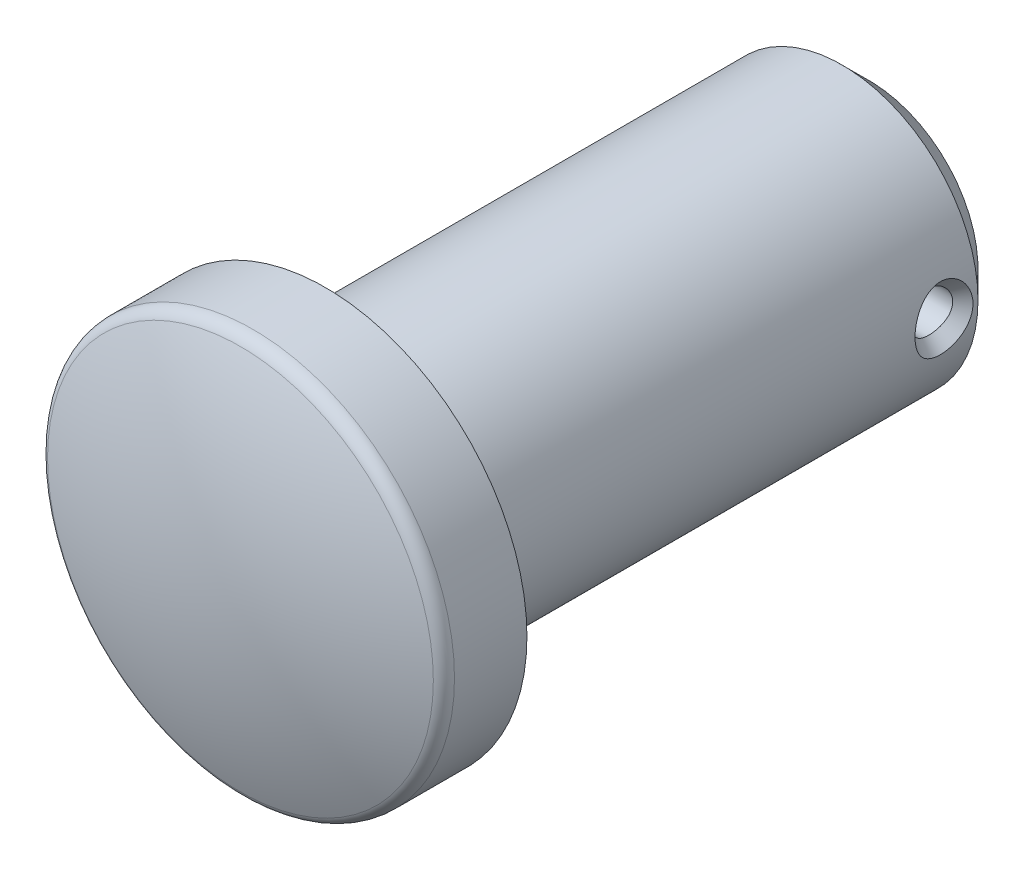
ISO-10303-21;
HEADER;
FILE_DESCRIPTION(('STEP AP214'),'2;1');
FILE_NAME('part.step','',(''),(''),'','','');
FILE_SCHEMA(('AUTOMOTIVE_DESIGN { 1 0 10303 214 1 1 1 1 }'));
ENDSEC;
DATA;
#1=APPLICATION_CONTEXT('core data for automotive mechanical design processes');
#2=APPLICATION_PROTOCOL_DEFINITION('international standard','automotive_design',2000,#1);
#3=PRODUCT_CONTEXT('',#1,'mechanical');
#4=PRODUCT('Part','Part','',(#3));
#5=PRODUCT_RELATED_PRODUCT_CATEGORY('part','',(#4));
#6=PRODUCT_DEFINITION_FORMATION('','',#4);
#7=PRODUCT_DEFINITION_CONTEXT('part definition',#1,'design');
#8=PRODUCT_DEFINITION('design','',#6,#7);
#9=PRODUCT_DEFINITION_SHAPE('','',#8);
#10=(LENGTH_UNIT() NAMED_UNIT(*) SI_UNIT(.MILLI.,.METRE.));
#11=(NAMED_UNIT(*) PLANE_ANGLE_UNIT() SI_UNIT($,.RADIAN.));
#12=(NAMED_UNIT(*) SI_UNIT($,.STERADIAN.) SOLID_ANGLE_UNIT());
#13=UNCERTAINTY_MEASURE_WITH_UNIT(LENGTH_MEASURE(1.E-05),#10,'distance_accuracy_value','');
#14=(GEOMETRIC_REPRESENTATION_CONTEXT(3) GLOBAL_UNCERTAINTY_ASSIGNED_CONTEXT((#13)) GLOBAL_UNIT_ASSIGNED_CONTEXT((#10,
#11,#12)) REPRESENTATION_CONTEXT('',''));
#15=CARTESIAN_POINT('',(0.,0.,0.));
#16=DIRECTION('',(0.,0.,1.));
#17=DIRECTION('',(1.,0.,0.));
#18=AXIS2_PLACEMENT_3D('',#15,#16,#17);
#19=CARTESIAN_POINT('',(5.852080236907,294.719989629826,0.));
#20=DIRECTION('',(0.,0.,1.));
#21=DIRECTION('',(1.,0.,0.));
#22=AXIS2_PLACEMENT_3D('',#19,#20,#21);
#23=PLANE('',#22);
#24=CARTESIAN_POINT('',(5.852080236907,294.719989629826,0.));
#25=DIRECTION('',(0.,0.,1.));
#26=DIRECTION('',(1.,0.,0.));
#27=AXIS2_PLACEMENT_3D('',#24,#25,#26);
#28=CIRCLE('',#27,14.8184804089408);
#29=CARTESIAN_POINT('',(20.6705606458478,294.719989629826,0.));
#30=VERTEX_POINT('',#29);
#31=EDGE_CURVE('E177',#30,#30,#28,.T.);
#32=ORIENTED_EDGE('',*,*,#31,.F.);
#33=EDGE_LOOP('',(#32));
#34=FACE_BOUND('',#33,.T.);
#35=CARTESIAN_POINT('',(5.852080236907,294.719989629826,0.));
#36=DIRECTION('',(0.,0.,1.));
#37=DIRECTION('',(1.,0.,0.));
#38=AXIS2_PLACEMENT_3D('',#35,#36,#37);
#39=CIRCLE('',#38,10.);
#40=CARTESIAN_POINT('',(15.852080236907,294.719989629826,0.));
#41=VERTEX_POINT('',#40);
#42=EDGE_CURVE('E180',#41,#41,#39,.F.);
#43=ORIENTED_EDGE('',*,*,#42,.F.);
#44=EDGE_LOOP('',(#43));
#45=FACE_BOUND('',#44,.T.);
#46=ADVANCED_FACE('F33',(#34,#45),#23,.F.);
#47=CARTESIAN_POINT('',(5.852080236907,294.719989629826,6.));
#48=DIRECTION('',(0.,0.,-1.));
#49=DIRECTION('',(-1.,0.,0.));
#50=AXIS2_PLACEMENT_3D('',#47,#48,#49);
#51=CYLINDRICAL_SURFACE('',#50,14.8184804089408);
#52=CARTESIAN_POINT('',(5.852080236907,294.719989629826,5.33034058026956));
#53=DIRECTION('',(0.,0.,-1.));
#54=DIRECTION('',(-1.,0.,0.));
#55=AXIS2_PLACEMENT_3D('',#52,#53,#54);
#56=CIRCLE('',#55,14.8184804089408);
#57=CARTESIAN_POINT('',(-8.9664001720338,294.719989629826,5.33034058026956));
#58=VERTEX_POINT('',#57);
#59=EDGE_CURVE('E60',#58,#58,#56,.T.);
#60=ORIENTED_EDGE('',*,*,#59,.T.);
#61=EDGE_LOOP('',(#60));
#62=FACE_BOUND('',#61,.T.);
#63=ORIENTED_EDGE('',*,*,#31,.T.);
#64=EDGE_LOOP('',(#63));
#65=FACE_BOUND('',#64,.T.);
#66=ADVANCED_FACE('F169',(#62,#65),#51,.T.);
#67=CARTESIAN_POINT('',(5.852080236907,294.719989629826,-29.0978936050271));
#68=DIRECTION('',(0.,0.,1.));
#69=DIRECTION('',(1.,0.,0.));
#70=AXIS2_PLACEMENT_3D('',#67,#68,#69);
#71=SPHERICAL_SURFACE('',#70,38.0978936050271);
#72=CARTESIAN_POINT('',(5.852080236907,294.719989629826,6.25837801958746));
#73=DIRECTION('',(0.,0.,-1.));
#74=DIRECTION('',(-1.,0.,0.));
#75=AXIS2_PLACEMENT_3D('',#72,#73,#74);
#76=CIRCLE('',#75,14.1909673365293);
#77=CARTESIAN_POINT('',(-8.33888709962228,294.719989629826,6.25837801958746));
#78=VERTEX_POINT('',#77);
#79=EDGE_CURVE('E65',#78,#78,#76,.F.);
#80=ORIENTED_EDGE('',*,*,#79,.T.);
#81=EDGE_LOOP('',(#80));
#82=FACE_BOUND('',#81,.T.);
#83=ADVANCED_FACE('F89',(#82),#71,.T.);
#84=CARTESIAN_POINT('',(5.852080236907,294.719989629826,-40.));
#85=DIRECTION('',(0.,0.,1.));
#86=DIRECTION('',(1.,0.,0.));
#87=AXIS2_PLACEMENT_3D('',#84,#85,#86);
#88=CYLINDRICAL_SURFACE('',#87,10.);
#89=CARTESIAN_POINT('',(15.852073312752,294.731757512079,-37.6315583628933));
#90=CARTESIAN_POINT('',(15.8520311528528,294.770087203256,-37.6309884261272));
#91=CARTESIAN_POINT('',(15.8517420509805,294.808401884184,-37.6295174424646));
#92=CARTESIAN_POINT('',(15.850695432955,294.88483731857,-37.6248028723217));
#93=CARTESIAN_POINT('',(15.8499388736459,294.922958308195,-37.6215629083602));
#94=CARTESIAN_POINT('',(15.8479843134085,294.998926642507,-37.6133452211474));
#95=CARTESIAN_POINT('',(15.8467871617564,295.036774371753,-37.6083708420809));
#96=CARTESIAN_POINT('',(15.8439784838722,295.11211744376,-37.5967193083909));
#97=CARTESIAN_POINT('',(15.8423677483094,295.149613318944,-37.5900454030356));
#98=CARTESIAN_POINT('',(15.8387588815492,295.224173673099,-37.5750295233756));
#99=CARTESIAN_POINT('',(15.8367615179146,295.261238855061,-37.5666908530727));
#100=CARTESIAN_POINT('',(15.8324063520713,295.334858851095,-37.5483800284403));
#101=CARTESIAN_POINT('',(15.8300493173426,295.371414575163,-37.5384113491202));
#102=CARTESIAN_POINT('',(15.8250017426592,295.443936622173,-37.5168749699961));
#103=CARTESIAN_POINT('',(15.8223119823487,295.479904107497,-37.5053110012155));
#104=CARTESIAN_POINT('',(15.816625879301,295.551170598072,-37.4806184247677));
#105=CARTESIAN_POINT('',(15.813630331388,295.58647106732,-37.4674938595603));
#106=CARTESIAN_POINT('',(15.8073595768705,295.656324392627,-37.4397144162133));
#107=CARTESIAN_POINT('',(15.8040851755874,295.690879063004,-37.4250639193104));
#108=CARTESIAN_POINT('',(15.7972836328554,295.759161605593,-37.3942669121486));
#109=CARTESIAN_POINT('',(15.7937572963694,295.792891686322,-37.3781251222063));
#110=CARTESIAN_POINT('',(15.7864788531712,295.859445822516,-37.3443798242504));
#111=CARTESIAN_POINT('',(15.7827275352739,295.892272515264,-37.3267813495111));
#112=CARTESIAN_POINT('',(15.7750259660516,295.95694060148,-37.2901570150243));
#113=CARTESIAN_POINT('',(15.771076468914,295.988785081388,-37.27113644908));
#114=CARTESIAN_POINT('',(15.7630059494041,296.051409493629,-37.2317022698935));
#115=CARTESIAN_POINT('',(15.7588856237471,296.082192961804,-37.2112941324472));
#116=CARTESIAN_POINT('',(15.7504988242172,296.142615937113,-37.1691193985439));
#117=CARTESIAN_POINT('',(15.7462329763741,296.172259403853,-37.147358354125));
#118=CARTESIAN_POINT('',(15.7375881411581,296.230323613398,-37.1025118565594));
#119=CARTESIAN_POINT('',(15.7332096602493,296.258748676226,-37.0794319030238));
#120=CARTESIAN_POINT('',(15.7243443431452,296.314295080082,-37.0319841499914));
#121=CARTESIAN_POINT('',(15.7198579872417,296.341421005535,-37.0076216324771));
#122=CARTESIAN_POINT('',(15.7108895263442,296.394279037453,-36.9576534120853));
#123=CARTESIAN_POINT('',(15.7064074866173,296.420016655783,-36.9320535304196));
#124=CARTESIAN_POINT('',(15.6975612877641,296.470048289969,-36.8796943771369));
#125=CARTESIAN_POINT('',(15.6931966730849,296.494348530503,-36.8529411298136));
#126=CARTESIAN_POINT('',(15.6845906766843,296.541467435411,-36.7983521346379));
#127=CARTESIAN_POINT('',(15.6803488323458,296.564292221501,-36.7705217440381));
#128=CARTESIAN_POINT('',(15.672021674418,296.608424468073,-36.7138528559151));
#129=CARTESIAN_POINT('',(15.6679357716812,296.629737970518,-36.6850191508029));
#130=CARTESIAN_POINT('',(15.6599463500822,296.670811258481,-36.6264185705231));
#131=CARTESIAN_POINT('',(15.6560421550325,296.690577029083,-36.5966559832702));
#132=CARTESIAN_POINT('',(15.6484439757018,296.72851859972,-36.5362723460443));
#133=CARTESIAN_POINT('',(15.6447492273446,296.746700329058,-36.5056551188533));
#134=CARTESIAN_POINT('',(15.6375972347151,296.781437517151,-36.4436369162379));
#135=CARTESIAN_POINT('',(15.6341391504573,296.79799882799,-36.412239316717));
#136=CARTESIAN_POINT('',(15.6274879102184,296.829458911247,-36.3487350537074));
#137=CARTESIAN_POINT('',(15.624293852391,296.84436340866,-36.3166313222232));
#138=CARTESIAN_POINT('',(15.6181980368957,296.872473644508,-36.2517894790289));
#139=CARTESIAN_POINT('',(15.6152953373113,296.885684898,-36.2190538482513));
#140=CARTESIAN_POINT('',(15.6098095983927,296.910372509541,-36.1530228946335));
#141=CARTESIAN_POINT('',(15.6072256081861,296.921854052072,-36.1197295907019));
#142=CARTESIAN_POINT('',(15.6024046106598,296.943046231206,-36.0526579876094));
#143=CARTESIAN_POINT('',(15.6001666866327,296.952761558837,-36.0188812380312));
#144=CARTESIAN_POINT('',(15.596065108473,296.970385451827,-35.9509174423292));
#145=CARTESIAN_POINT('',(15.5942006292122,296.978298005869,-35.916731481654));
#146=CARTESIAN_POINT('',(15.5908731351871,296.992280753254,-35.8480239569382));
#147=CARTESIAN_POINT('',(15.589409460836,296.998353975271,-35.8135030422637));
#148=CARTESIAN_POINT('',(15.5869108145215,297.008622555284,-35.7442002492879));
#149=CARTESIAN_POINT('',(15.5858754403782,297.012819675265,-35.7094186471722));
#150=CARTESIAN_POINT('',(15.5842600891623,297.019301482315,-35.6396691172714));
#151=CARTESIAN_POINT('',(15.5836800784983,297.02158631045,-35.6047012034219));
#152=CARTESIAN_POINT('',(15.5830037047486,297.024206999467,-35.5346533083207));
#153=CARTESIAN_POINT('',(15.5829078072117,297.024540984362,-35.4995732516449));
#154=CARTESIAN_POINT('',(15.5832212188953,297.02323385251,-35.4294469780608));
#155=CARTESIAN_POINT('',(15.5836306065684,297.021592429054,-35.3944007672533));
#156=CARTESIAN_POINT('',(15.5849218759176,297.016375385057,-35.324485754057));
#157=CARTESIAN_POINT('',(15.5858034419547,297.012801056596,-35.2896168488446));
#158=CARTESIAN_POINT('',(15.5880110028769,297.003756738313,-35.2201282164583));
#159=CARTESIAN_POINT('',(15.589337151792,296.998286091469,-35.185508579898));
#160=CARTESIAN_POINT('',(15.5924042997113,296.985489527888,-35.1165902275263));
#161=CARTESIAN_POINT('',(15.5941457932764,296.978161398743,-35.0822919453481));
#162=CARTESIAN_POINT('',(15.598014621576,296.961689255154,-35.0140878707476));
#163=CARTESIAN_POINT('',(15.6001426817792,296.952541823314,-34.9801829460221));
#164=CARTESIAN_POINT('',(15.6047556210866,296.932470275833,-34.9128370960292));
#165=CARTESIAN_POINT('',(15.6072413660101,296.921541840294,-34.8793975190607));
#166=CARTESIAN_POINT('',(15.6125407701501,296.897947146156,-34.8130538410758));
#167=CARTESIAN_POINT('',(15.6153553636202,296.885275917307,-34.7801515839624));
#168=CARTESIAN_POINT('',(15.621283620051,296.858234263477,-34.7149540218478));
#169=CARTESIAN_POINT('',(15.6243982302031,296.843858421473,-34.6826610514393));
#170=CARTESIAN_POINT('',(15.6308977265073,296.813445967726,-34.6187535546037));
#171=CARTESIAN_POINT('',(15.6342835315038,296.797403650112,-34.587141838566));
#172=CARTESIAN_POINT('',(15.641296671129,296.763696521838,-34.5246683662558));
#173=CARTESIAN_POINT('',(15.6449248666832,296.746025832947,-34.4938098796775));
#174=CARTESIAN_POINT('',(15.6523940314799,296.709100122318,-34.4329144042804));
#175=CARTESIAN_POINT('',(15.6562357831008,296.689839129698,-34.4028811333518));
#176=CARTESIAN_POINT('',(15.664103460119,296.649770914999,-34.3437076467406));
#177=CARTESIAN_POINT('',(15.6681300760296,296.628957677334,-34.314571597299));
#178=CARTESIAN_POINT('',(15.6763383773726,296.585822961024,-34.2572641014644));
#179=CARTESIAN_POINT('',(15.6805206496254,296.563495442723,-34.2290972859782));
#180=CARTESIAN_POINT('',(15.6890131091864,296.51737039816,-34.1737998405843));
#181=CARTESIAN_POINT('',(15.6933237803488,296.493566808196,-34.1466743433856));
#182=CARTESIAN_POINT('',(15.7020385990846,296.444526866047,-34.0935308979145));
#183=CARTESIAN_POINT('',(15.7064430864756,296.419284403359,-34.0675186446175));
#184=CARTESIAN_POINT('',(15.715338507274,296.367407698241,-34.0166736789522));
#185=CARTESIAN_POINT('',(15.7198297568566,296.340767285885,-33.9918473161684));
#186=CARTESIAN_POINT('',(15.7287851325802,296.286143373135,-33.9434626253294));
#187=CARTESIAN_POINT('',(15.7332490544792,296.258154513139,-33.9199103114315));
#188=CARTESIAN_POINT('',(15.7420399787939,296.200922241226,-33.8741241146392));
#189=CARTESIAN_POINT('',(15.7463663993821,296.171674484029,-33.8518955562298));
#190=CARTESIAN_POINT('',(15.754878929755,296.112007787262,-33.8087894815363));
#191=CARTESIAN_POINT('',(15.759064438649,296.081584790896,-33.7879174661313));
#192=CARTESIAN_POINT('',(15.7672639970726,296.019647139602,-33.747556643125));
#193=CARTESIAN_POINT('',(15.7712773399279,295.98812879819,-33.7280733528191));
#194=CARTESIAN_POINT('',(15.7791088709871,295.924080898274,-33.6905224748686));
#195=CARTESIAN_POINT('',(15.7829262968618,295.89154808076,-33.672460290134));
#196=CARTESIAN_POINT('',(15.7903402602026,295.825551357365,-33.6377842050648));
#197=CARTESIAN_POINT('',(15.7939359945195,295.792084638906,-33.6211754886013));
#198=CARTESIAN_POINT('',(15.8008813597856,295.724300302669,-33.5894390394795));
#199=CARTESIAN_POINT('',(15.8042301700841,295.689980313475,-33.5743161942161));
#200=CARTESIAN_POINT('',(15.8106563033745,295.620569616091,-33.5455842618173));
#201=CARTESIAN_POINT('',(15.8137328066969,295.585476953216,-33.5319797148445));
#202=CARTESIAN_POINT('',(15.8195889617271,295.514601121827,-33.5063172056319));
#203=CARTESIAN_POINT('',(15.8223678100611,295.478816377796,-33.494263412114));
#204=CARTESIAN_POINT('',(15.8276032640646,295.406636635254,-33.4717352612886));
#205=CARTESIAN_POINT('',(15.8300590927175,295.370240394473,-33.4612647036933));
#206=CARTESIAN_POINT('',(15.8346231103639,295.296917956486,-33.4419358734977));
#207=CARTESIAN_POINT('',(15.8367305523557,295.259990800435,-33.4330810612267));
#208=CARTESIAN_POINT('',(15.8405723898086,295.185686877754,-33.4170165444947));
#209=CARTESIAN_POINT('',(15.8423060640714,295.148309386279,-33.4098100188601));
#210=CARTESIAN_POINT('',(15.8453749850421,295.073185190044,-33.3970748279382));
#211=CARTESIAN_POINT('',(15.8467095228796,295.035437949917,-33.3915491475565));
#212=CARTESIAN_POINT('',(15.8489547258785,294.959654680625,-33.3822083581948));
#213=CARTESIAN_POINT('',(15.8498646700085,294.921618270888,-33.3783961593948));
#214=CARTESIAN_POINT('',(15.8512355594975,294.84533717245,-33.3725147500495));
#215=CARTESIAN_POINT('',(15.8516957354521,294.807092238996,-33.370448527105));
#216=CARTESIAN_POINT('',(15.852140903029,294.730474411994,-33.3680919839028));
#217=CARTESIAN_POINT('',(15.8521250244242,294.692101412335,-33.3678049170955));
#218=CARTESIAN_POINT('',(15.8515965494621,294.615379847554,-33.3690358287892));
#219=CARTESIAN_POINT('',(15.8510838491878,294.577031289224,-33.370554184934));
#220=CARTESIAN_POINT('',(15.8495913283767,294.500511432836,-33.3753636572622));
#221=CARTESIAN_POINT('',(15.8486121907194,294.462339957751,-33.3786521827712));
#222=CARTESIAN_POINT('',(15.8462135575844,294.386255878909,-33.3869668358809));
#223=CARTESIAN_POINT('',(15.8447946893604,294.348342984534,-33.3919904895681));
#224=CARTESIAN_POINT('',(15.8415443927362,294.272857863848,-33.4037398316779));
#225=CARTESIAN_POINT('',(15.8397135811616,294.235285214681,-33.4104629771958));
#226=CARTESIAN_POINT('',(15.8356668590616,294.160562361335,-33.4255760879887));
#227=CARTESIAN_POINT('',(15.833451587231,294.123411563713,-33.4339632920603));
#228=CARTESIAN_POINT('',(15.8286634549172,294.049614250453,-33.4523694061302));
#229=CARTESIAN_POINT('',(15.8260912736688,294.012966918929,-33.4623852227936));
#230=CARTESIAN_POINT('',(15.8206167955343,293.940258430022,-33.4840135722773));
#231=CARTESIAN_POINT('',(15.8177152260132,293.904196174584,-33.4956225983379));
#232=CARTESIAN_POINT('',(15.8116094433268,293.832739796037,-33.5204024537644));
#233=CARTESIAN_POINT('',(15.8084060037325,293.797344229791,-33.5335693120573));
#234=CARTESIAN_POINT('',(15.8017239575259,293.727303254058,-33.5614299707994));
#235=CARTESIAN_POINT('',(15.798246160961,293.692655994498,-33.5761193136));
#236=CARTESIAN_POINT('',(15.791042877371,293.624193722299,-33.6069901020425));
#237=CARTESIAN_POINT('',(15.787318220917,293.590376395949,-33.623166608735));
#238=CARTESIAN_POINT('',(15.7796487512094,293.523656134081,-33.6569768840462));
#239=CARTESIAN_POINT('',(15.7757047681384,293.490750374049,-33.6746052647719));
#240=CARTESIAN_POINT('',(15.7676240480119,293.42593545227,-33.7112844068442));
#241=CARTESIAN_POINT('',(15.7634881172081,293.394022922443,-33.7303293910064));
#242=CARTESIAN_POINT('',(15.7550514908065,293.331276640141,-33.7698068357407));
#243=CARTESIAN_POINT('',(15.7507515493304,293.300438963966,-33.7902332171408));
#244=CARTESIAN_POINT('',(15.7420128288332,293.239924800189,-33.8324383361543));
#245=CARTESIAN_POINT('',(15.7375747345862,293.210243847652,-33.8542108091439));
#246=CARTESIAN_POINT('',(15.7285933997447,293.15212469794,-33.8990733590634));
#247=CARTESIAN_POINT('',(15.7240507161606,293.123681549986,-33.9221571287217));
#248=CARTESIAN_POINT('',(15.7148652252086,293.068122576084,-33.9696055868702));
#249=CARTESIAN_POINT('',(15.7102229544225,293.04100139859,-33.9939641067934));
#250=CARTESIAN_POINT('',(15.7009514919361,292.988169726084,-34.0439221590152));
#251=CARTESIAN_POINT('',(15.6963223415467,292.962453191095,-34.0695153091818));
#252=CARTESIAN_POINT('',(15.6871910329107,292.912469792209,-34.1218623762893));
#253=CARTESIAN_POINT('',(15.6826883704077,292.888196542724,-34.1486101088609));
#254=CARTESIAN_POINT('',(15.6738152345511,292.84113732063,-34.2031893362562));
#255=CARTESIAN_POINT('',(15.669444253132,292.81834508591,-34.2310153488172));
#256=CARTESIAN_POINT('',(15.6608680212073,292.774282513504,-34.2876760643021));
#257=CARTESIAN_POINT('',(15.6566621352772,292.753006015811,-34.3165058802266));
#258=CARTESIAN_POINT('',(15.6484420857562,292.712010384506,-34.3750987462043));
#259=CARTESIAN_POINT('',(15.6444272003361,292.69228516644,-34.4048574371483));
#260=CARTESIAN_POINT('',(15.6366171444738,292.654427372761,-34.4652327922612));
#261=CARTESIAN_POINT('',(15.6328211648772,292.63628878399,-34.4958455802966));
#262=CARTESIAN_POINT('',(15.6254763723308,292.601639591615,-34.5578538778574));
#263=CARTESIAN_POINT('',(15.6219266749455,292.585123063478,-34.5892459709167));
#264=CARTESIAN_POINT('',(15.6151020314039,292.553753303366,-34.652737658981));
#265=CARTESIAN_POINT('',(15.6118261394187,292.538894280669,-34.6848342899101));
#266=CARTESIAN_POINT('',(15.6055766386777,292.510874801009,-34.7496598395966));
#267=CARTESIAN_POINT('',(15.6026020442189,292.497708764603,-34.7823862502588));
#268=CARTESIAN_POINT('',(15.5969826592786,292.473110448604,-34.84839614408));
#269=CARTESIAN_POINT('',(15.5943368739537,292.461672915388,-34.8816775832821));
#270=CARTESIAN_POINT('',(15.5894025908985,292.44056667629,-34.948722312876));
#271=CARTESIAN_POINT('',(15.5871131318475,292.430893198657,-34.9824840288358));
#272=CARTESIAN_POINT('',(15.5829189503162,292.41334999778,-35.0504140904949));
#273=CARTESIAN_POINT('',(15.5810133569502,292.405476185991,-35.0845813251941));
#274=CARTESIAN_POINT('',(15.5776142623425,292.391566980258,-35.1532472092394));
#275=CARTESIAN_POINT('',(15.5761200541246,292.385528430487,-35.1877451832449));
#276=CARTESIAN_POINT('',(15.5735711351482,292.375324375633,-35.2569973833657));
#277=CARTESIAN_POINT('',(15.5725159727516,292.371156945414,-35.2917513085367));
#278=CARTESIAN_POINT('',(15.5708719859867,292.364728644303,-35.3614402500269));
#279=CARTESIAN_POINT('',(15.5702830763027,292.362467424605,-35.3963752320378));
#280=CARTESIAN_POINT('',(15.569600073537,292.359887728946,-35.4663514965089));
#281=CARTESIAN_POINT('',(15.5695063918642,292.35957086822,-35.5013928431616));
#282=CARTESIAN_POINT('',(15.5698353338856,292.360903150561,-35.5714401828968));
#283=CARTESIAN_POINT('',(15.5702580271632,292.36255255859,-35.6064461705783));
#284=CARTESIAN_POINT('',(15.57158649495,292.367775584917,-35.6762838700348));
#285=CARTESIAN_POINT('',(15.5724919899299,292.371348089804,-35.7111156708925));
#286=CARTESIAN_POINT('',(15.5747578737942,292.380380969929,-35.7805329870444));
#287=CARTESIAN_POINT('',(15.5761184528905,292.385842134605,-35.8151183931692));
#288=CARTESIAN_POINT('',(15.5792647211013,292.39861342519,-35.8839709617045));
#289=CARTESIAN_POINT('',(15.5810509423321,292.405925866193,-35.9182376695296));
#290=CARTESIAN_POINT('',(15.5850193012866,292.422361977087,-35.9863810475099));
#291=CARTESIAN_POINT('',(15.5872022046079,292.431489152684,-36.020256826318));
#292=CARTESIAN_POINT('',(15.5919347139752,292.451517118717,-36.0875466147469));
#293=CARTESIAN_POINT('',(15.5944852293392,292.462422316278,-36.1209592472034));
#294=CARTESIAN_POINT('',(15.5999238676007,292.485969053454,-36.1872510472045));
#295=CARTESIAN_POINT('',(15.602812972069,292.498615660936,-36.2201283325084));
#296=CARTESIAN_POINT('',(15.6088997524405,292.525608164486,-36.2852777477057));
#297=CARTESIAN_POINT('',(15.6120984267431,292.5399595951,-36.3175474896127));
#298=CARTESIAN_POINT('',(15.6187753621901,292.570324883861,-36.3814101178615));
#299=CARTESIAN_POINT('',(15.6222545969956,292.586344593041,-36.4130001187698));
#300=CARTESIAN_POINT('',(15.6294637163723,292.620009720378,-36.4754315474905));
#301=CARTESIAN_POINT('',(15.6331945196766,292.637661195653,-36.5062696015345));
#302=CARTESIAN_POINT('',(15.6408778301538,292.674553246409,-36.5671254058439));
#303=CARTESIAN_POINT('',(15.6448311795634,292.693800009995,-36.5971392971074));
#304=CARTESIAN_POINT('',(15.6529307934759,292.733846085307,-36.6562750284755));
#305=CARTESIAN_POINT('',(15.6570778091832,292.75465167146,-36.6853925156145));
#306=CARTESIAN_POINT('',(15.6655354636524,292.79777893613,-36.7426637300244));
#307=CARTESIAN_POINT('',(15.6698467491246,292.820106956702,-36.77081258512));
#308=CARTESIAN_POINT('',(15.6786056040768,292.866242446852,-36.8260747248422));
#309=CARTESIAN_POINT('',(15.6830537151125,292.890056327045,-36.853182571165));
#310=CARTESIAN_POINT('',(15.6920515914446,292.939127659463,-36.9062913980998));
#311=CARTESIAN_POINT('',(15.6966017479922,292.964391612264,-36.9322863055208));
#312=CARTESIAN_POINT('',(15.7057965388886,293.016324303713,-36.9830962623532));
#313=CARTESIAN_POINT('',(15.7104415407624,293.042999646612,-37.0079044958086));
#314=CARTESIAN_POINT('',(15.7197115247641,293.097702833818,-37.0562533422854));
#315=CARTESIAN_POINT('',(15.7243363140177,293.125736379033,-37.0797875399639));
#316=CARTESIAN_POINT('',(15.733455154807,293.183061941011,-37.1255395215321));
#317=CARTESIAN_POINT('',(15.7379486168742,293.212358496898,-37.1477517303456));
#318=CARTESIAN_POINT('',(15.746801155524,293.272126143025,-37.1908266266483));
#319=CARTESIAN_POINT('',(15.7511596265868,293.302601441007,-37.2116835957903));
#320=CARTESIAN_POINT('',(15.7597107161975,293.364645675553,-37.2520164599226));
#321=CARTESIAN_POINT('',(15.7639026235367,293.396218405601,-37.2714866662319));
#322=CARTESIAN_POINT('',(15.7720965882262,293.460375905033,-37.3090138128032));
#323=CARTESIAN_POINT('',(15.7760978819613,293.492964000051,-37.3270652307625));
#324=CARTESIAN_POINT('',(15.7838845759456,293.559070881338,-37.3617225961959));
#325=CARTESIAN_POINT('',(15.7876691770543,293.592592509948,-37.3783232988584));
#326=CARTESIAN_POINT('',(15.7949969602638,293.660485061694,-37.4100468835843));
#327=CARTESIAN_POINT('',(15.7985393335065,293.694858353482,-37.4251648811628));
#328=CARTESIAN_POINT('',(15.805356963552,293.764372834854,-37.4538906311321));
#329=CARTESIAN_POINT('',(15.8086314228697,293.799515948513,-37.4674939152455));
#330=CARTESIAN_POINT('',(15.8148875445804,293.870488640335,-37.4931577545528));
#331=CARTESIAN_POINT('',(15.8178684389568,293.906319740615,-37.5052142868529));
#332=CARTESIAN_POINT('',(15.823511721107,293.978586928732,-37.5277521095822));
#333=CARTESIAN_POINT('',(15.826173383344,294.015024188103,-37.5382298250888));
#334=CARTESIAN_POINT('',(15.8311524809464,294.088422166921,-37.5575774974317));
#335=CARTESIAN_POINT('',(15.8334692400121,294.12538376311,-37.5664443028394));
#336=CARTESIAN_POINT('',(15.8377328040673,294.199748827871,-37.582537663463));
#337=CARTESIAN_POINT('',(15.8396789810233,294.237152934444,-37.5897614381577));
#338=CARTESIAN_POINT('',(15.8431756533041,294.31232139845,-37.6025362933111));
#339=CARTESIAN_POINT('',(15.8447255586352,294.3500862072,-37.6080848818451));
#340=CARTESIAN_POINT('',(15.8474039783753,294.425894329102,-37.6174770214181));
#341=CARTESIAN_POINT('',(15.8485319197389,294.463937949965,-37.6213182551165));
#342=CARTESIAN_POINT('',(15.85034069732,294.540222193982,-37.6272633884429));
#343=CARTESIAN_POINT('',(15.8510209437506,294.578463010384,-37.6293649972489));
#344=CARTESIAN_POINT('',(15.8519087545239,294.655059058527,-37.6317989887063));
#345=CARTESIAN_POINT('',(15.8521156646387,294.693414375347,-37.6321289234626));
#346=CARTESIAN_POINT('',(15.852073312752,294.731757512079,-37.6315583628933));
#347=B_SPLINE_CURVE_WITH_KNOTS('',3,(#89,#90,#91,#92,#93,#94,#95,#96,#97,#98,#99,#100,#101,#102,
#103,#104,#105,#106,#107,#108,#109,#110,#111,#112,#113,#114,#115,#116,#117,#118,#119,#120,#121,
#122,#123,#124,#125,#126,#127,#128,#129,#130,#131,#132,#133,#134,#135,#136,#137,#138,#139,#140,
#141,#142,#143,#144,#145,#146,#147,#148,#149,#150,#151,#152,#153,#154,#155,#156,#157,#158,#159,
#160,#161,#162,#163,#164,#165,#166,#167,#168,#169,#170,#171,#172,#173,#174,#175,#176,#177,#178,
#179,#180,#181,#182,#183,#184,#185,#186,#187,#188,#189,#190,#191,#192,#193,#194,#195,#196,#197,
#198,#199,#200,#201,#202,#203,#204,#205,#206,#207,#208,#209,#210,#211,#212,#213,#214,#215,#216,
#217,#218,#219,#220,#221,#222,#223,#224,#225,#226,#227,#228,#229,#230,#231,#232,#233,#234,#235,
#236,#237,#238,#239,#240,#241,#242,#243,#244,#245,#246,#247,#248,#249,#250,#251,#252,#253,#254,
#255,#256,#257,#258,#259,#260,#261,#262,#263,#264,#265,#266,#267,#268,#269,#270,#271,#272,#273,
#274,#275,#276,#277,#278,#279,#280,#281,#282,#283,#284,#285,#286,#287,#288,#289,#290,#291,#292,
#293,#294,#295,#296,#297,#298,#299,#300,#301,#302,#303,#304,#305,#306,#307,#308,#309,#310,#311,
#312,#313,#314,#315,#316,#317,#318,#319,#320,#321,#322,#323,#324,#325,#326,#327,#328,#329,#330,
#331,#332,#333,#334,#335,#336,#337,#338,#339,#340,#341,#342,#343,#344,#345,#346),.UNSPECIFIED.,
.F.,.F.,(4,2,2,2,2,2,2,2,2,2,2,2,2,2,2,2,2,2,2,2,2,2,2,2,2,2,2,2,2,2,2,2,2,2,2,2,2,2,2,2,2,2,2,
2,2,2,2,2,2,2,2,2,2,2,2,2,2,2,2,2,2,2,2,2,2,2,2,2,2,2,2,2,2,2,2,2,2,2,2,2,2,2,2,2,2,2,2,2,2,2,2,
2,2,2,2,2,2,2,2,2,2,2,2,2,2,2,2,2,2,2,2,2,2,2,2,2,2,2,2,2,2,2,2,2,2,2,2,2,4),(0.,
0.114988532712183,0.22974247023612,0.344276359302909,0.45859289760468,0.572684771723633,
0.686536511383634,0.800126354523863,0.913428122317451,1.02641310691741,1.13905197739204,
1.25131671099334,1.36318255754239,1.47463004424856,1.58564702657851,1.69623078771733,
1.80639018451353,1.91607399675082,2.02524153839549,2.13392242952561,2.24214096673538,
2.34991791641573,2.45727235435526,2.56422354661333,2.67079286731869,2.77700574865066,
2.88289365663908,2.98849608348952,3.09386254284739,3.19905454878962,3.30414755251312,
3.4092328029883,3.51441908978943,3.61962171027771,3.72475409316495,3.8299229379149,
3.9352176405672,4.0407120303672,4.14646621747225,4.25252851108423,4.3589373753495,
4.46572339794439,4.5729112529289,4.68052164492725,4.78857322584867,4.89708447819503,
5.00607556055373,5.11557011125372,5.22559700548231,5.33610462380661,5.44703027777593,
5.55838080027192,5.6701515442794,5.78232853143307,5.89489055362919,6.00781122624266,
6.12106099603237,6.2346091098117,6.34842555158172,6.46248295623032,6.57675850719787,
6.69123582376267,6.80590684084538,6.92077368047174,7.03585050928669,7.15095141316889,
7.26588432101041,7.38065403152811,7.49525302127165,7.60966342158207,7.72385899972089,
7.83780714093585,7.95147083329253,8.06481066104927,8.17778681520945,8.29036113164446,
8.40249916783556,8.51417232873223,8.62536005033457,8.73605204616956,8.84625061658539,
8.95593040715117,9.0650819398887,9.17373704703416,9.28192188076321,9.38965870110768,
9.4969677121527,9.60386894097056,9.71038415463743,9.81653881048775,9.9223640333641,
10.0278986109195,10.1331909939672,10.2383012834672,10.3433031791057,10.4482858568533,
10.5533557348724,10.6584397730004,10.7634630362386,10.868530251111,10.9737295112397,
11.0791340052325,11.184803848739,11.2907879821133,11.3971261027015,11.5038506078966,
11.6109885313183,11.718563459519,11.8265974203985,11.9351127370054,12.0441338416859,
12.1536890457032,12.2638122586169,12.3744464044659,12.4855181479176,12.5970316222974,
12.7089789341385,12.8213423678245,12.934096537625,13.0472104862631,13.1606497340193,
13.2743782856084,13.3883606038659,13.5025635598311,13.6169583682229,13.7315225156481,
13.8462416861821,13.9611116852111,14.0761403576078),.UNSPECIFIED.);
#348=CARTESIAN_POINT('',(15.852073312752,294.731757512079,-37.6315583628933));
#349=VERTEX_POINT('',#348);
#350=EDGE_CURVE('E50',#349,#349,#347,.F.);
#351=ORIENTED_EDGE('',*,*,#350,.T.);
#352=EDGE_LOOP('',(#351));
#353=FACE_BOUND('',#352,.T.);
#354=CARTESIAN_POINT('',(-4.14788715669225,294.694452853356,-37.6318662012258));
#355=CARTESIAN_POINT('',(-4.1477950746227,294.656112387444,-37.6319288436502));
#356=CARTESIAN_POINT('',(-4.14745473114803,294.617772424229,-37.6310900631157));
#357=CARTESIAN_POINT('',(-4.14630269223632,294.54125296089,-37.6276370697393));
#358=CARTESIAN_POINT('',(-4.14549189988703,294.503073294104,-37.6250262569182));
#359=CARTESIAN_POINT('',(-4.14342544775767,294.426954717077,-37.6180629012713));
#360=CARTESIAN_POINT('',(-4.14217058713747,294.389015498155,-37.6137134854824));
#361=CARTESIAN_POINT('',(-4.13924256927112,294.313457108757,-37.6033067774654));
#362=CARTESIAN_POINT('',(-4.13757015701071,294.27583749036,-37.5972525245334));
#363=CARTESIAN_POINT('',(-4.13383351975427,294.200997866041,-37.5834697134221));
#364=CARTESIAN_POINT('',(-4.13177002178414,294.163777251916,-37.5757442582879));
#365=CARTESIAN_POINT('',(-4.12727767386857,294.089815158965,-37.5586524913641));
#366=CARTESIAN_POINT('',(-4.12484955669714,294.053072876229,-37.5492894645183));
#367=CARTESIAN_POINT('',(-4.11965440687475,293.980147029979,-37.5289558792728));
#368=CARTESIAN_POINT('',(-4.11688812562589,293.9439624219,-37.5179888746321));
#369=CARTESIAN_POINT('',(-4.11104307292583,293.872231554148,-37.4944805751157));
#370=CARTESIAN_POINT('',(-4.10796507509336,293.83668395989,-37.481943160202));
#371=CARTESIAN_POINT('',(-4.10152301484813,293.766306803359,-37.4553272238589));
#372=CARTESIAN_POINT('',(-4.09815974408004,293.731475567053,-37.4412529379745));
#373=CARTESIAN_POINT('',(-4.09117355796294,293.662610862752,-37.4115964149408));
#374=CARTESIAN_POINT('',(-4.08755144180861,293.628575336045,-37.3960187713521));
#375=CARTESIAN_POINT('',(-4.08007403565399,293.561381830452,-37.3633886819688));
#376=CARTESIAN_POINT('',(-4.07621953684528,293.528221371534,-37.3463411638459));
#377=CARTESIAN_POINT('',(-4.06830370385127,293.462857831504,-37.3108045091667));
#378=CARTESIAN_POINT('',(-4.0642431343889,293.430651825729,-37.292320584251));
#379=CARTESIAN_POINT('',(-4.05594206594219,293.367276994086,-37.2539443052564));
#380=CARTESIAN_POINT('',(-4.05170228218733,293.336104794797,-37.2340573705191));
#381=CARTESIAN_POINT('',(-4.04306767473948,293.274877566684,-37.1929084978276));
#382=CARTESIAN_POINT('',(-4.03867350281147,293.244818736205,-37.1716520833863));
#383=CARTESIAN_POINT('',(-4.0297625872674,293.18589751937,-37.1277971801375));
#384=CARTESIAN_POINT('',(-4.02524638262,293.157030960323,-37.1052041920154));
#385=CARTESIAN_POINT('',(-4.01609584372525,293.100576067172,-37.0587114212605));
#386=CARTESIAN_POINT('',(-4.01146202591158,293.072983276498,-37.0348169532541));
#387=CARTESIAN_POINT('',(-4.00218780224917,293.019165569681,-36.985764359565));
#388=CARTESIAN_POINT('',(-3.99754751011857,292.992935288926,-36.9606121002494));
#389=CARTESIAN_POINT('',(-3.98837463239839,292.941892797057,-36.9091262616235));
#390=CARTESIAN_POINT('',(-3.98384164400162,292.917074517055,-36.8827987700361));
#391=CARTESIAN_POINT('',(-3.97489014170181,292.868895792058,-36.8290381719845));
#392=CARTESIAN_POINT('',(-3.97047120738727,292.845529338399,-36.8016105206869));
#393=CARTESIAN_POINT('',(-3.96178233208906,292.800291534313,-36.7457229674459));
#394=CARTESIAN_POINT('',(-3.95751183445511,292.778414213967,-36.717267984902));
#395=CARTESIAN_POINT('',(-3.94914695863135,292.736192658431,-36.6593996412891));
#396=CARTESIAN_POINT('',(-3.94505192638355,292.715842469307,-36.6299907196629));
#397=CARTESIAN_POINT('',(-3.93706706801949,292.676713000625,-36.5702881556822));
#398=CARTESIAN_POINT('',(-3.93317648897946,292.657927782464,-36.539998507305));
#399=CARTESIAN_POINT('',(-3.92562909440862,292.621966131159,-36.4786081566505));
#400=CARTESIAN_POINT('',(-3.92197143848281,292.604783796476,-36.4475110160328));
#401=CARTESIAN_POINT('',(-3.91491857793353,292.572065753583,-36.3845793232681));
#402=CARTESIAN_POINT('',(-3.91152245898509,292.556524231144,-36.3527478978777));
#403=CARTESIAN_POINT('',(-3.90502130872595,292.527125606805,-36.2884212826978));
#404=CARTESIAN_POINT('',(-3.90191531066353,292.51326286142,-36.255928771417));
#405=CARTESIAN_POINT('',(-3.89602302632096,292.487259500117,-36.1903536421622));
#406=CARTESIAN_POINT('',(-3.89323575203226,292.475113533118,-36.1572732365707));
#407=CARTESIAN_POINT('',(-3.88800950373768,292.452581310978,-36.0905959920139));
#408=CARTESIAN_POINT('',(-3.88556956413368,292.442190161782,-36.0570008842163));
#409=CARTESIAN_POINT('',(-3.88106653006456,292.423204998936,-35.9893679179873));
#410=CARTESIAN_POINT('',(-3.87900255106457,292.414606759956,-35.9553313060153));
#411=CARTESIAN_POINT('',(-3.87527991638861,292.399244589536,-35.8868890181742));
#412=CARTESIAN_POINT('',(-3.87362053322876,292.392477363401,-35.8524841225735));
#413=CARTESIAN_POINT('',(-3.87073550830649,292.380814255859,-35.783378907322));
#414=CARTESIAN_POINT('',(-3.86950939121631,292.375916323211,-35.7486789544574));
#415=CARTESIAN_POINT('',(-3.8675191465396,292.368028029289,-35.6790572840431));
#416=CARTESIAN_POINT('',(-3.86675491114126,292.365037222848,-35.6441356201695));
#417=CARTESIAN_POINT('',(-3.86571682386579,292.361000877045,-35.5741437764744));
#418=CARTESIAN_POINT('',(-3.8654433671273,292.359956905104,-35.5390734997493));
#419=CARTESIAN_POINT('',(-3.86541413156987,292.359844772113,-35.4689310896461));
#420=CARTESIAN_POINT('',(-3.86565833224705,292.360776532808,-35.4338589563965));
#421=CARTESIAN_POINT('',(-3.86663686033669,292.364579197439,-35.3638590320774));
#422=CARTESIAN_POINT('',(-3.86737075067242,292.367448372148,-35.328931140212));
#423=CARTESIAN_POINT('',(-3.86930004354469,292.37508811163,-35.2592923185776));
#424=CARTESIAN_POINT('',(-3.87049551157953,292.379858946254,-35.2245814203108));
#425=CARTESIAN_POINT('',(-3.87331924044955,292.391262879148,-35.155449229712));
#426=CARTESIAN_POINT('',(-3.87494793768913,292.397897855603,-35.1210282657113));
#427=CARTESIAN_POINT('',(-3.87860960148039,292.412991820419,-35.0525483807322));
#428=CARTESIAN_POINT('',(-3.88064326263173,292.421453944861,-35.0184901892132));
#429=CARTESIAN_POINT('',(-3.88508642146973,292.440164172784,-34.9508082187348));
#430=CARTESIAN_POINT('',(-3.88749677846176,292.450416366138,-34.9171856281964));
#431=CARTESIAN_POINT('',(-3.89266499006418,292.472669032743,-34.8504471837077));
#432=CARTESIAN_POINT('',(-3.89542379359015,292.484674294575,-34.81733300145));
#433=CARTESIAN_POINT('',(-3.90126062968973,292.510395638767,-34.7516836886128));
#434=CARTESIAN_POINT('',(-3.90433964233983,292.524117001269,-34.7191507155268));
#435=CARTESIAN_POINT('',(-3.91078868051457,292.553233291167,-34.6547361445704));
#436=CARTESIAN_POINT('',(-3.91415967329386,292.568633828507,-34.6228571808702));
#437=CARTESIAN_POINT('',(-3.92116450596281,292.601071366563,-34.5598229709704));
#438=CARTESIAN_POINT('',(-3.92479926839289,292.618114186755,-34.5286708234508));
#439=CARTESIAN_POINT('',(-3.93230346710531,292.653799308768,-34.4671626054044));
#440=CARTESIAN_POINT('',(-3.936173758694,292.672447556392,-34.4368100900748));
#441=CARTESIAN_POINT('',(-3.94412100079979,292.711306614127,-34.3769735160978));
#442=CARTESIAN_POINT('',(-3.94819872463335,292.731523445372,-34.3474934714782));
#443=CARTESIAN_POINT('',(-3.95653231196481,292.773482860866,-34.2894741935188));
#444=CARTESIAN_POINT('',(-3.96078885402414,292.795231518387,-34.2609394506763));
#445=CARTESIAN_POINT('',(-3.96945351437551,292.840217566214,-34.2048832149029));
#446=CARTESIAN_POINT('',(-3.97386221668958,292.86346108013,-34.1773667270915));
#447=CARTESIAN_POINT('',(-3.98279733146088,292.911400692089,-34.123419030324));
#448=CARTESIAN_POINT('',(-3.98732419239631,292.936102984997,-34.0969934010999));
#449=CARTESIAN_POINT('',(-3.99648923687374,292.986920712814,-34.0453007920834));
#450=CARTESIAN_POINT('',(-4.00112785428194,293.01304242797,-34.0200400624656));
#451=CARTESIAN_POINT('',(-4.01040315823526,293.066650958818,-33.9707644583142));
#452=CARTESIAN_POINT('',(-4.01503974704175,293.094143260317,-33.9467555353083));
#453=CARTESIAN_POINT('',(-4.02419962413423,293.150405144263,-33.9000329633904));
#454=CARTESIAN_POINT('',(-4.02872241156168,293.179179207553,-33.8773246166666));
#455=CARTESIAN_POINT('',(-4.0376499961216,293.237922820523,-33.8332376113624));
#456=CARTESIAN_POINT('',(-4.04205426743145,293.267896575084,-33.8118644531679));
#457=CARTESIAN_POINT('',(-4.05071230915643,293.328961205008,-33.7704810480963));
#458=CARTESIAN_POINT('',(-4.05496543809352,293.360055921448,-33.7504763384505));
#459=CARTESIAN_POINT('',(-4.06329615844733,293.423283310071,-33.7118635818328));
#460=CARTESIAN_POINT('',(-4.06737304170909,293.455419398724,-33.6932609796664));
#461=CARTESIAN_POINT('',(-4.07532419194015,293.520650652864,-33.6574862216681));
#462=CARTESIAN_POINT('',(-4.07919769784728,293.553748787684,-33.6403193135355));
#463=CARTESIAN_POINT('',(-4.08671553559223,293.620825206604,-33.6074498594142));
#464=CARTESIAN_POINT('',(-4.09035907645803,293.654806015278,-33.5917522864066));
#465=CARTESIAN_POINT('',(-4.09739025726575,293.723568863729,-33.5618554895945));
#466=CARTESIAN_POINT('',(-4.10077709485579,293.758353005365,-33.547660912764));
#467=CARTESIAN_POINT('',(-4.10726816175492,293.828643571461,-33.5208041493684));
#468=CARTESIAN_POINT('',(-4.11037159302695,293.864151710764,-33.5081462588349));
#469=CARTESIAN_POINT('',(-4.11626911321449,293.935811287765,-33.4843969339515));
#470=CARTESIAN_POINT('',(-4.11906241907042,293.971964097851,-33.4733094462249));
#471=CARTESIAN_POINT('',(-4.12431294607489,294.044833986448,-33.4527349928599));
#472=CARTESIAN_POINT('',(-4.12676940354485,294.081552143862,-33.443251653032));
#473=CARTESIAN_POINT('',(-4.13131948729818,294.155473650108,-33.4259195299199));
#474=CARTESIAN_POINT('',(-4.13341236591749,294.192677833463,-33.4180741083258));
#475=CARTESIAN_POINT('',(-4.13720854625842,294.267492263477,-33.4040518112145));
#476=CARTESIAN_POINT('',(-4.13891110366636,294.305103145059,-33.39787811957));
#477=CARTESIAN_POINT('',(-4.14189992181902,294.380651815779,-33.3872331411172));
#478=CARTESIAN_POINT('',(-4.14318541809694,294.418590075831,-33.3827649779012));
#479=CARTESIAN_POINT('',(-4.14531337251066,294.494714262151,-33.3755649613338));
#480=CARTESIAN_POINT('',(-4.14615500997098,294.532900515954,-33.3728363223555));
#481=CARTESIAN_POINT('',(-4.14736871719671,294.609441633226,-33.3691484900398));
#482=CARTESIAN_POINT('',(-4.14773986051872,294.647796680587,-33.3681927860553));
#483=CARTESIAN_POINT('',(-4.14798522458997,294.724525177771,-33.3680861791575));
#484=CARTESIAN_POINT('',(-4.14785926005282,294.762898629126,-33.3689359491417));
#485=CARTESIAN_POINT('',(-4.14713420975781,294.83951069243,-33.3724142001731));
#486=CARTESIAN_POINT('',(-4.14653572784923,294.877749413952,-33.3750404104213));
#487=CARTESIAN_POINT('',(-4.14489206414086,294.954008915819,-33.3820366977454));
#488=CARTESIAN_POINT('',(-4.14384743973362,294.99202990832,-33.3864045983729));
#489=CARTESIAN_POINT('',(-4.14133767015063,295.06777062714,-33.396850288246));
#490=CARTESIAN_POINT('',(-4.13987308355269,295.105490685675,-33.4029258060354));
#491=CARTESIAN_POINT('',(-4.13654957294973,295.18054624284,-33.4167527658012));
#492=CARTESIAN_POINT('',(-4.13469124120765,295.21788223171,-33.4245016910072));
#493=CARTESIAN_POINT('',(-4.13060638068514,295.292086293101,-33.4416416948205));
#494=CARTESIAN_POINT('',(-4.12838049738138,295.328955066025,-33.4510298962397));
#495=CARTESIAN_POINT('',(-4.12358666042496,295.40214128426,-33.4714147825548));
#496=CARTESIAN_POINT('',(-4.1210194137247,295.438459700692,-33.4824081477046));
#497=CARTESIAN_POINT('',(-4.11556896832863,295.510461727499,-33.5059697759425));
#498=CARTESIAN_POINT('',(-4.11268653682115,295.546146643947,-33.5185342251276));
#499=CARTESIAN_POINT('',(-4.10663184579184,295.616798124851,-33.5452044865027));
#500=CARTESIAN_POINT('',(-4.10346040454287,295.651766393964,-33.5593059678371));
#501=CARTESIAN_POINT('',(-4.09685381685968,295.720900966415,-33.58901678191));
#502=CARTESIAN_POINT('',(-4.09341952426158,295.755069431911,-33.6046212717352));
#503=CARTESIAN_POINT('',(-4.08631341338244,295.822520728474,-33.6373045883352));
#504=CARTESIAN_POINT('',(-4.08264246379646,295.855806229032,-33.6543780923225));
#505=CARTESIAN_POINT('',(-4.07508908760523,295.921407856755,-33.689965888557));
#506=CARTESIAN_POINT('',(-4.07120752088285,295.95372719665,-33.7084744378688));
#507=CARTESIAN_POINT('',(-4.06325954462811,296.017312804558,-33.7468987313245));
#508=CARTESIAN_POINT('',(-4.0591939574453,296.048582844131,-33.766808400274));
#509=CARTESIAN_POINT('',(-4.05090251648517,296.109985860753,-33.8080012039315));
#510=CARTESIAN_POINT('',(-4.04667742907,296.140123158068,-33.8292780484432));
#511=CARTESIAN_POINT('',(-4.03809931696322,296.199177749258,-33.8731715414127));
#512=CARTESIAN_POINT('',(-4.03374694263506,296.22809986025,-33.8957818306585));
#513=CARTESIAN_POINT('',(-4.02491796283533,296.284637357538,-33.9423077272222));
#514=CARTESIAN_POINT('',(-4.02044199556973,296.31225798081,-33.9662170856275));
#515=CARTESIAN_POINT('',(-4.01147746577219,296.366109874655,-34.0152996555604));
#516=CARTESIAN_POINT('',(-4.00698906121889,296.39234706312,-34.0404664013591));
#517=CARTESIAN_POINT('',(-3.99811395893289,296.44339415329,-34.0919815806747));
#518=CARTESIAN_POINT('',(-3.99372687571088,296.468210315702,-34.1183237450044));
#519=CARTESIAN_POINT('',(-3.9850603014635,296.516375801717,-34.1721144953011));
#520=CARTESIAN_POINT('',(-3.98078041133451,296.539731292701,-34.1995574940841));
#521=CARTESIAN_POINT('',(-3.97236240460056,296.584939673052,-34.2554755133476));
#522=CARTESIAN_POINT('',(-3.96822375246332,296.606798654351,-34.2839455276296));
#523=CARTESIAN_POINT('',(-3.96011486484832,296.648977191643,-34.341843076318));
#524=CARTESIAN_POINT('',(-3.95614399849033,296.669302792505,-34.3712661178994));
#525=CARTESIAN_POINT('',(-3.94839932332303,296.70837798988,-34.4309953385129));
#526=CARTESIAN_POINT('',(-3.94462478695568,296.727133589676,-34.4612974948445));
#527=CARTESIAN_POINT('',(-3.93730087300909,296.763032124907,-34.5227105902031));
#528=CARTESIAN_POINT('',(-3.9337506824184,296.780181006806,-34.5538179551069));
#529=CARTESIAN_POINT('',(-3.92690369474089,296.812829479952,-34.6167671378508));
#530=CARTESIAN_POINT('',(-3.9236060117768,296.828334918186,-34.6486058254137));
#531=CARTESIAN_POINT('',(-3.91729222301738,296.857659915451,-34.7129433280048));
#532=CARTESIAN_POINT('',(-3.91427517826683,296.871485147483,-34.7454394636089));
#533=CARTESIAN_POINT('',(-3.90855083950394,296.897413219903,-34.8110175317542));
#534=CARTESIAN_POINT('',(-3.90584258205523,296.909521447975,-34.8440972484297));
#535=CARTESIAN_POINT('',(-3.9007639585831,296.931979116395,-34.9107681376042));
#536=CARTESIAN_POINT('',(-3.89839264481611,296.942333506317,-34.9443575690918));
#537=CARTESIAN_POINT('',(-3.89401600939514,296.961247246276,-35.0119735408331));
#538=CARTESIAN_POINT('',(-3.89200980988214,296.969810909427,-35.0459988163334));
#539=CARTESIAN_POINT('',(-3.88839144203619,296.985107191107,-35.1144121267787));
#540=CARTESIAN_POINT('',(-3.88677853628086,296.991843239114,-35.1487993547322));
#541=CARTESIAN_POINT('',(-3.88397473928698,297.003448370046,-35.2178622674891));
#542=CARTESIAN_POINT('',(-3.88278333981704,297.008319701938,-35.2525375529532));
#543=CARTESIAN_POINT('',(-3.88085038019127,297.016160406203,-35.3221022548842));
#544=CARTESIAN_POINT('',(-3.8801086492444,297.01913050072,-35.3569915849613));
#545=CARTESIAN_POINT('',(-3.87910298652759,297.023131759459,-35.4269104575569));
#546=CARTESIAN_POINT('',(-3.87883934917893,297.024161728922,-35.4619400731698));
#547=CARTESIAN_POINT('',(-3.87881680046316,297.024254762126,-35.531999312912));
#548=CARTESIAN_POINT('',(-3.87905785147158,297.023317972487,-35.567028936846));
#549=CARTESIAN_POINT('',(-3.8800173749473,297.019514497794,-35.6369488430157));
#550=CARTESIAN_POINT('',(-3.88073547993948,297.016649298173,-35.6718392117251));
#551=CARTESIAN_POINT('',(-3.88262093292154,297.009024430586,-35.7414076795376));
#552=CARTESIAN_POINT('',(-3.88378838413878,297.0042643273,-35.7760857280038));
#553=CARTESIAN_POINT('',(-3.88654425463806,296.992886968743,-35.8451566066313));
#554=CARTESIAN_POINT('',(-3.88813312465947,296.98626772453,-35.8795490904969));
#555=CARTESIAN_POINT('',(-3.89170374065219,296.971208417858,-35.9479760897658));
#556=CARTESIAN_POINT('',(-3.89368617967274,296.962765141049,-35.982009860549));
#557=CARTESIAN_POINT('',(-3.89801592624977,296.944093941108,-36.0496467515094));
#558=CARTESIAN_POINT('',(-3.90036408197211,296.933861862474,-36.0832486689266));
#559=CARTESIAN_POINT('',(-3.90539734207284,296.911648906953,-36.1499492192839));
#560=CARTESIAN_POINT('',(-3.90808337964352,296.899663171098,-36.1830461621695));
#561=CARTESIAN_POINT('',(-3.9137645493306,296.873978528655,-36.2486641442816));
#562=CARTESIAN_POINT('',(-3.91676064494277,296.860274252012,-36.2811829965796));
#563=CARTESIAN_POINT('',(-3.92303412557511,296.831187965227,-36.3455721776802));
#564=CARTESIAN_POINT('',(-3.92631246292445,296.815800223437,-36.3774398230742));
#565=CARTESIAN_POINT('',(-3.93312267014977,296.783382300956,-36.4404539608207));
#566=CARTESIAN_POINT('',(-3.93665545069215,296.766346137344,-36.4715972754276));
#567=CARTESIAN_POINT('',(-3.9439467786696,296.730666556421,-36.5330901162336));
#568=CARTESIAN_POINT('',(-3.94770617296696,296.712016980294,-36.5634359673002));
#569=CARTESIAN_POINT('',(-3.95542312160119,296.673145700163,-36.623261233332));
#570=CARTESIAN_POINT('',(-3.95938144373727,296.65291770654,-36.6527364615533));
#571=CARTESIAN_POINT('',(-3.96746813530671,296.610924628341,-36.7107478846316));
#572=CARTESIAN_POINT('',(-3.97159717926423,296.589153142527,-36.7392793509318));
#573=CARTESIAN_POINT('',(-3.9799991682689,296.544108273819,-36.7953305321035));
#574=CARTESIAN_POINT('',(-3.98427269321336,296.520828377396,-36.8228449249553));
#575=CARTESIAN_POINT('',(-3.99293016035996,296.47280122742,-36.8767898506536));
#576=CARTESIAN_POINT('',(-3.99731454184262,296.448047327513,-36.9032143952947));
#577=CARTESIAN_POINT('',(-4.00618787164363,296.397109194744,-36.9549054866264));
#578=CARTESIAN_POINT('',(-4.01067724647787,296.370918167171,-36.9801652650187));
#579=CARTESIAN_POINT('',(-4.01964672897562,296.317158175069,-37.0294381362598));
#580=CARTESIAN_POINT('',(-4.02412669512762,296.289583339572,-37.0534448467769));
#581=CARTESIAN_POINT('',(-4.03296562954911,296.233150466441,-37.1001615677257));
#582=CARTESIAN_POINT('',(-4.03732404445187,296.20428775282,-37.1228660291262));
#583=CARTESIAN_POINT('',(-4.04591585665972,296.14536206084,-37.166943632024));
#584=CARTESIAN_POINT('',(-4.05014868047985,296.115294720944,-37.1883110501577));
#585=CARTESIAN_POINT('',(-4.05845729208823,296.054040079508,-37.2296818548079));
#586=CARTESIAN_POINT('',(-4.06253239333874,296.022848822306,-37.2496795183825));
#587=CARTESIAN_POINT('',(-4.07050106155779,295.959427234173,-37.2882773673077));
#588=CARTESIAN_POINT('',(-4.07439388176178,295.927193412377,-37.3068719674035));
#589=CARTESIAN_POINT('',(-4.08197143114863,295.861767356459,-37.3426302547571));
#590=CARTESIAN_POINT('',(-4.08565536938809,295.828572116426,-37.3597886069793));
#591=CARTESIAN_POINT('',(-4.09278912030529,295.761303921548,-37.3926408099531));
#592=CARTESIAN_POINT('',(-4.09623812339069,295.727228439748,-37.4083296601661));
#593=CARTESIAN_POINT('',(-4.10287579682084,295.658280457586,-37.4382091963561));
#594=CARTESIAN_POINT('',(-4.10606365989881,295.623405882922,-37.4523952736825));
#595=CARTESIAN_POINT('',(-4.11215286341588,295.552940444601,-37.4792355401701));
#596=CARTESIAN_POINT('',(-4.1150534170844,295.517347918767,-37.4918855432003));
#597=CARTESIAN_POINT('',(-4.12054178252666,295.445527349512,-37.5156199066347));
#598=CARTESIAN_POINT('',(-4.12312884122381,295.409298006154,-37.5267005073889));
#599=CARTESIAN_POINT('',(-4.12796398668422,295.336284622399,-37.5472623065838));
#600=CARTESIAN_POINT('',(-4.13021136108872,295.299499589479,-37.5567401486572));
#601=CARTESIAN_POINT('',(-4.13434090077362,295.225455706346,-37.5740626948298));
#602=CARTESIAN_POINT('',(-4.13622239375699,295.188196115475,-37.5819043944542));
#603=CARTESIAN_POINT('',(-4.13959393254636,295.113284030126,-37.5959209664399));
#604=CARTESIAN_POINT('',(-4.14108333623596,295.075630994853,-37.6020931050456));
#605=CARTESIAN_POINT('',(-4.14364447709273,295.000013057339,-37.612736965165));
#606=CARTESIAN_POINT('',(-4.14471558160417,294.962047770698,-37.6172061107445));
#607=CARTESIAN_POINT('',(-4.14641389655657,294.885886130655,-37.6244104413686));
#608=CARTESIAN_POINT('',(-4.14704045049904,294.847689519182,-37.6271430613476));
#609=CARTESIAN_POINT('',(-4.1478235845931,294.771147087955,-37.6308411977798));
#610=CARTESIAN_POINT('',(-4.14797943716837,294.732801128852,-37.6318039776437));
#611=CARTESIAN_POINT('',(-4.14788715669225,294.694452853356,-37.6318662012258));
#612=B_SPLINE_CURVE_WITH_KNOTS('',3,(#354,#355,#356,#357,#358,#359,#360,#361,#362,#363,#364,
#365,#366,#367,#368,#369,#370,#371,#372,#373,#374,#375,#376,#377,#378,#379,#380,#381,#382,#383,
#384,#385,#386,#387,#388,#389,#390,#391,#392,#393,#394,#395,#396,#397,#398,#399,#400,#401,#402,
#403,#404,#405,#406,#407,#408,#409,#410,#411,#412,#413,#414,#415,#416,#417,#418,#419,#420,#421,
#422,#423,#424,#425,#426,#427,#428,#429,#430,#431,#432,#433,#434,#435,#436,#437,#438,#439,#440,
#441,#442,#443,#444,#445,#446,#447,#448,#449,#450,#451,#452,#453,#454,#455,#456,#457,#458,#459,
#460,#461,#462,#463,#464,#465,#466,#467,#468,#469,#470,#471,#472,#473,#474,#475,#476,#477,#478,
#479,#480,#481,#482,#483,#484,#485,#486,#487,#488,#489,#490,#491,#492,#493,#494,#495,#496,#497,
#498,#499,#500,#501,#502,#503,#504,#505,#506,#507,#508,#509,#510,#511,#512,#513,#514,#515,#516,
#517,#518,#519,#520,#521,#522,#523,#524,#525,#526,#527,#528,#529,#530,#531,#532,#533,#534,#535,
#536,#537,#538,#539,#540,#541,#542,#543,#544,#545,#546,#547,#548,#549,#550,#551,#552,#553,#554,
#555,#556,#557,#558,#559,#560,#561,#562,#563,#564,#565,#566,#567,#568,#569,#570,#571,#572,#573,
#574,#575,#576,#577,#578,#579,#580,#581,#582,#583,#584,#585,#586,#587,#588,#589,#590,#591,#592,
#593,#594,#595,#596,#597,#598,#599,#600,#601,#602,#603,#604,#605,#606,#607,#608,#609,#610,#611),
.UNSPECIFIED.,.F.,.F.,(4,2,2,2,2,2,2,2,2,2,2,2,2,2,2,2,2,2,2,2,2,2,2,2,2,2,2,2,2,2,2,2,2,2,2,2,
2,2,2,2,2,2,2,2,2,2,2,2,2,2,2,2,2,2,2,2,2,2,2,2,2,2,2,2,2,2,2,2,2,2,2,2,2,2,2,2,2,2,2,2,2,2,2,2,
2,2,2,2,2,2,2,2,2,2,2,2,2,2,2,2,2,2,2,2,2,2,2,2,2,2,2,2,2,2,2,2,2,2,2,2,2,2,2,2,2,2,2,2,4),(0.,
0.115008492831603,0.229796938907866,0.344379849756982,0.458759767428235,0.572929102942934,
0.686871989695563,0.800566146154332,0.913984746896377,1.02709830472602,1.13987656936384,
1.25229044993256,1.36431396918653,1.4759262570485,1.58711358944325,1.69787147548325,
1.80820679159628,1.91806835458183,2.0274151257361,2.13627417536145,2.24466739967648,
2.35261332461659,2.46012895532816,2.56723166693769,2.67394113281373,2.78028128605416,
2.88628230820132,2.99198263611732,3.09743097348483,3.20268828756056,3.30782976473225,
3.41294669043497,3.51814821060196,3.62334556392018,3.72844914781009,3.83356765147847,
3.93879244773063,4.04419930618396,4.14985022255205,4.25579532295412,4.36207481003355,
4.46872092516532,4.57575990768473,4.68321393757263,4.79110305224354,4.89944703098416,
5.00826724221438,5.11758844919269,5.22744056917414,5.33777459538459,5.4485303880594,
5.55971586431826,5.67132745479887,5.7833522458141,5.89577007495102,6.00855557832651,
6.12168019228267,6.23511411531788,6.34882823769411,6.46279604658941,6.57699551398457,
6.69141097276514,6.80603498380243,6.92087019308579,7.03593117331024,7.15103504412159,
7.26599205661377,7.38080586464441,7.4954676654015,7.60995820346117,7.72424977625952,
7.83830823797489,7.95209500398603,8.06556906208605,8.17868899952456,8.29141505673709,
8.40371121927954,8.51554735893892,8.6269014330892,8.73776174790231,8.84812928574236,
8.95797828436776,9.06729867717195,9.1761210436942,9.28447023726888,9.39236717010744,
9.49983064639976,9.60687923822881,9.71353320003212,9.81981641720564,9.92575838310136,
10.0313961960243,10.1367765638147,10.2419577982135,10.3470117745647,10.4520258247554,
10.5571045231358,10.6621753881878,10.7671654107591,10.8721795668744,10.9773064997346,
11.0826202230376,11.188181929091,11.2940418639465,11.4002412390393,11.5068141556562,
11.6137895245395,11.7211929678,11.829048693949,11.9373813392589,12.0462177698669,
12.1555888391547,12.2655310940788,12.3759874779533,12.4868840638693,12.5982267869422,
12.7100094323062,12.8222158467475,12.9348220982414,13.0477985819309,13.1611120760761,
13.2747277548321,13.3886111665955,13.5027301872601,13.6170569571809,13.7315698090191,
13.8462551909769,13.9611095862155,14.0761414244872),.UNSPECIFIED.);
#613=CARTESIAN_POINT('',(-4.14788715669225,294.694452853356,-37.6318662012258));
#614=VERTEX_POINT('',#613);
#615=EDGE_CURVE('E55',#614,#614,#612,.F.);
#616=ORIENTED_EDGE('',*,*,#615,.T.);
#617=EDGE_LOOP('',(#616));
#618=FACE_BOUND('',#617,.T.);
#619=CARTESIAN_POINT('',(5.852080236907,294.719989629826,-38.));
#620=DIRECTION('',(0.,0.,-1.));
#621=DIRECTION('',(-1.,0.,0.));
#622=AXIS2_PLACEMENT_3D('',#619,#620,#621);
#623=CIRCLE('',#622,10.);
#624=CARTESIAN_POINT('',(-4.14791976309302,294.719989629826,-38.));
#625=VERTEX_POINT('',#624);
#626=EDGE_CURVE('E70',#625,#625,#623,.F.);
#627=ORIENTED_EDGE('',*,*,#626,.T.);
#628=EDGE_LOOP('',(#627));
#629=FACE_BOUND('',#628,.T.);
#630=ORIENTED_EDGE('',*,*,#42,.T.);
#631=EDGE_LOOP('',(#630));
#632=FACE_BOUND('',#631,.T.);
#633=ADVANCED_FACE('F78',(#353,#618,#629,#632),#88,.T.);
#634=CARTESIAN_POINT('',(5.852080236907,294.719989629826,-40.));
#635=DIRECTION('',(0.,0.,-1.));
#636=DIRECTION('',(-1.,0.,0.));
#637=AXIS2_PLACEMENT_3D('',#634,#635,#636);
#638=PLANE('',#637);
#639=CARTESIAN_POINT('',(5.852080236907,294.719989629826,-40.));
#640=DIRECTION('',(0.,0.,-1.));
#641=DIRECTION('',(-1.,0.,0.));
#642=AXIS2_PLACEMENT_3D('',#639,#640,#641);
#643=CIRCLE('',#642,8.00000000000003);
#644=CARTESIAN_POINT('',(-2.14791976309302,294.719989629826,-40.));
#645=VERTEX_POINT('',#644);
#646=EDGE_CURVE('E182',#645,#645,#643,.T.);
#647=ORIENTED_EDGE('',*,*,#646,.T.);
#648=EDGE_LOOP('',(#647));
#649=FACE_BOUND('',#648,.T.);
#650=ADVANCED_FACE('F88',(#649),#638,.T.);
#651=CARTESIAN_POINT('',(5.852080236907,294.719989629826,-40.));
#652=DIRECTION('',(0.,0.,1.));
#653=DIRECTION('',(1.,0.,0.));
#654=AXIS2_PLACEMENT_3D('',#651,#652,#653);
#655=CONICAL_SURFACE('',#654,8.00000000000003,0.785398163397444);
#656=ORIENTED_EDGE('',*,*,#626,.F.);
#657=EDGE_LOOP('',(#656));
#658=FACE_BOUND('',#657,.T.);
#659=ORIENTED_EDGE('',*,*,#646,.F.);
#660=EDGE_LOOP('',(#659));
#661=FACE_BOUND('',#660,.T.);
#662=ADVANCED_FACE('F191',(#658,#661),#655,.T.);
#663=CARTESIAN_POINT('',(5.852080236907,294.719989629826,5.33034058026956));
#664=DIRECTION('',(0.,0.,-1.));
#665=DIRECTION('',(-1.,0.,0.));
#666=AXIS2_PLACEMENT_3D('',#663,#664,#665);
#667=TOROIDAL_SURFACE('',#666,13.8184804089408,1.);
#668=ORIENTED_EDGE('',*,*,#59,.F.);
#669=EDGE_LOOP('',(#668));
#670=FACE_BOUND('',#669,.T.);
#671=ORIENTED_EDGE('',*,*,#79,.F.);
#672=EDGE_LOOP('',(#671));
#673=FACE_BOUND('',#672,.T.);
#674=ADVANCED_FACE('F113',(#670,#673),#667,.T.);
#675=CARTESIAN_POINT('',(-8.9664001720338,294.694452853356,-35.5));
#676=DIRECTION('',(1.,0.,0.));
#677=DIRECTION('',(0.,0.,-1.));
#678=AXIS2_PLACEMENT_3D('',#675,#676,#677);
#679=CYLINDRICAL_SURFACE('',#678,1.5);
#680=CARTESIAN_POINT('',(14.9932568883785,294.719989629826,-36.9997826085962));
#681=CARTESIAN_POINT('',(14.9938757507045,294.325116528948,-37.0062086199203));
#682=CARTESIAN_POINT('',(14.9361043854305,293.932921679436,-36.8501827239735));
#683=CARTESIAN_POINT('',(14.7999272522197,293.369804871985,-36.3057060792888));
#684=CARTESIAN_POINT('',(14.7375320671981,293.201552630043,-35.9201989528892));
#685=CARTESIAN_POINT('',(14.7326831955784,293.187790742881,-35.1310436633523));
#686=CARTESIAN_POINT('',(14.7912506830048,293.343632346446,-34.7391946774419));
#687=CARTESIAN_POINT('',(14.9274318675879,293.887360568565,-34.1767198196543));
#688=CARTESIAN_POINT('',(14.9891837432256,294.274695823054,-34.0071420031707));
#689=CARTESIAN_POINT('',(14.996941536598,295.064930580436,-33.9932627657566));
#690=CARTESIAN_POINT('',(14.9422385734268,295.456213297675,-34.1494286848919));
#691=CARTESIAN_POINT('',(14.8106711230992,296.018479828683,-34.6943035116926));
#692=CARTESIAN_POINT('',(14.7496611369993,296.187497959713,-35.0799837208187));
#693=CARTESIAN_POINT('',(14.7450408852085,296.2009920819,-35.8700781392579));
#694=CARTESIAN_POINT('',(14.8024091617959,296.044372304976,-36.2618301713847));
#695=CARTESIAN_POINT('',(14.9341677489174,295.500289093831,-36.8244865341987));
#696=CARTESIAN_POINT('',(14.9926380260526,295.114862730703,-36.9933565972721));
#697=CARTESIAN_POINT('',(14.9932568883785,294.719989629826,-36.9997826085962));
#698=B_SPLINE_CURVE_WITH_KNOTS('',3,(#680,#681,#682,#683,#684,#685,#686,#687,#688,#689,#690,
#691,#692,#693,#694,#695,#696,#697),.UNSPECIFIED.,.T.,.F.,(4,2,2,2,2,2,2,2,4),
(0.000520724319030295,0.00219194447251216,0.00386316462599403,0.0055343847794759,
0.00720560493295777,0.00887682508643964,0.0105480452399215,0.0122192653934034,
0.0138904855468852),.UNSPECIFIED.);
#699=CARTESIAN_POINT('',(14.9932568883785,294.719989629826,-36.9997826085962));
#700=VERTEX_POINT('',#699);
#701=EDGE_CURVE('E10',#700,#700,#698,.F.);
#702=ORIENTED_EDGE('',*,*,#701,.T.);
#703=EDGE_LOOP('',(#702));
#704=FACE_BOUND('',#703,.T.);
#705=CARTESIAN_POINT('',(-3.28907293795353,294.695995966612,-36.999999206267));
#706=CARTESIAN_POINT('',(-3.29042260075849,295.090954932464,-36.999296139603));
#707=CARTESIAN_POINT('',(-3.23362942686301,295.480310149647,-36.8361921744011));
#708=CARTESIAN_POINT('',(-3.10184431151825,296.033727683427,-36.2813095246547));
#709=CARTESIAN_POINT('',(-3.04295845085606,296.194914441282,-35.8925104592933));
#710=CARTESIAN_POINT('',(-3.04328376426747,296.193988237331,-35.1032270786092));
#711=CARTESIAN_POINT('',(-3.10262090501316,296.031005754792,-34.7144418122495));
#712=CARTESIAN_POINT('',(-3.23431112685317,295.476788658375,-34.1618089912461));
#713=CARTESIAN_POINT('',(-3.29084806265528,295.085806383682,-33.9993994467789));
#714=CARTESIAN_POINT('',(-3.28725277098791,294.295509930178,-34.0006101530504));
#715=CARTESIAN_POINT('',(-3.22727190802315,293.90765396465,-34.1639440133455));
#716=CARTESIAN_POINT('',(-3.091023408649,293.355838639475,-34.7188363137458));
#717=CARTESIAN_POINT('',(-3.03066110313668,293.193890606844,-35.1076687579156));
#718=CARTESIAN_POINT('',(-3.03108397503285,293.195020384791,-35.897962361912));
#719=CARTESIAN_POINT('',(-3.09200265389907,293.358775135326,-36.2864442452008));
#720=CARTESIAN_POINT('',(-3.22822982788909,293.912729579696,-36.8387882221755));
#721=CARTESIAN_POINT('',(-3.28772327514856,294.30103700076,-37.0007022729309));
#722=CARTESIAN_POINT('',(-3.28907293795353,294.695995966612,-36.999999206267));
#723=B_SPLINE_CURVE_WITH_KNOTS('',3,(#705,#706,#707,#708,#709,#710,#711,#712,#713,#714,#715,
#716,#717,#718,#719,#720,#721,#722),.UNSPECIFIED.,.T.,.F.,(4,2,2,2,2,2,2,2,4),
(0.000527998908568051,0.00219921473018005,0.00387043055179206,0.00554164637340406,
0.00721286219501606,0.00888407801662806,0.0105552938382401,0.0122265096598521,
0.0138977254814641),.UNSPECIFIED.);
#724=CARTESIAN_POINT('',(-3.28907293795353,294.695995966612,-36.999999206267));
#725=VERTEX_POINT('',#724);
#726=EDGE_CURVE('E45',#725,#725,#723,.F.);
#727=ORIENTED_EDGE('',*,*,#726,.T.);
#728=EDGE_LOOP('',(#727));
#729=FACE_BOUND('',#728,.T.);
#730=ADVANCED_FACE('F104',(#704,#729),#679,.F.);
#731=CARTESIAN_POINT('',(15.852073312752,294.731757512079,-37.6315583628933));
#732=CARTESIAN_POINT('',(15.852750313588,294.117823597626,-37.6406912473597));
#733=CARTESIAN_POINT('',(15.7895513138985,293.508046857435,-37.4189402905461));
#734=CARTESIAN_POINT('',(15.6405802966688,292.632529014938,-36.6451056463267));
#735=CARTESIAN_POINT('',(15.5723230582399,292.370935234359,-36.0972043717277));
#736=CARTESIAN_POINT('',(15.5670186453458,292.349538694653,-34.9756239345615));
#737=CARTESIAN_POINT('',(15.6310885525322,292.591836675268,-34.4187093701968));
#738=CARTESIAN_POINT('',(15.7800640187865,293.437209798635,-33.6192947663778));
#739=CARTESIAN_POINT('',(15.8476175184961,294.039430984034,-33.3782831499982));
#740=CARTESIAN_POINT('',(15.8561041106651,295.268058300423,-33.3585574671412));
#741=CARTESIAN_POINT('',(15.7962618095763,295.876416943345,-33.5805074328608));
#742=CARTESIAN_POINT('',(15.652333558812,296.750612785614,-34.3549079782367));
#743=CARTESIAN_POINT('',(15.5855916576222,297.013397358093,-34.9030553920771));
#744=CARTESIAN_POINT('',(15.5805373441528,297.034377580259,-36.02597028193));
#745=CARTESIAN_POINT('',(15.6432953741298,296.790869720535,-36.5827471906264));
#746=CARTESIAN_POINT('',(15.7874327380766,295.944944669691,-37.3824197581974));
#747=CARTESIAN_POINT('',(15.851396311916,295.345691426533,-37.6224254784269));
#748=CARTESIAN_POINT('',(15.852073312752,294.731757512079,-37.6315583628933));
#749=CARTESIAN_POINT('',(14.9932568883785,294.719989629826,-36.9997826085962));
#750=CARTESIAN_POINT('',(14.9938757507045,294.325116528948,-37.0062086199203));
#751=CARTESIAN_POINT('',(14.9361043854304,293.932921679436,-36.8501827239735));
#752=CARTESIAN_POINT('',(14.7999272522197,293.369804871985,-36.3057060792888));
#753=CARTESIAN_POINT('',(14.737532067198,293.201552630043,-35.9201989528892));
#754=CARTESIAN_POINT('',(14.7326831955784,293.187790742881,-35.1310436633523));
#755=CARTESIAN_POINT('',(14.7912506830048,293.343632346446,-34.7391946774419));
#756=CARTESIAN_POINT('',(14.9274318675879,293.887360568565,-34.1767198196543));
#757=CARTESIAN_POINT('',(14.9891837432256,294.274695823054,-34.0071420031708));
#758=CARTESIAN_POINT('',(14.996941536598,295.064930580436,-33.9932627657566));
#759=CARTESIAN_POINT('',(14.9422385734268,295.456213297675,-34.1494286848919));
#760=CARTESIAN_POINT('',(14.8106711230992,296.018479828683,-34.6943035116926));
#761=CARTESIAN_POINT('',(14.7496611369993,296.187497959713,-35.0799837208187));
#762=CARTESIAN_POINT('',(14.7450408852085,296.2009920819,-35.8700781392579));
#763=CARTESIAN_POINT('',(14.8024091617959,296.044372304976,-36.2618301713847));
#764=CARTESIAN_POINT('',(14.9341677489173,295.500289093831,-36.8244865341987));
#765=CARTESIAN_POINT('',(14.9926380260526,295.114862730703,-36.9933565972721));
#766=CARTESIAN_POINT('',(14.9932568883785,294.719989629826,-36.9997826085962));
#767=B_SPLINE_SURFACE_WITH_KNOTS('',1,3,((#731,#732,#733,#734,#735,#736,#737,#738,#739,#740,
#741,#742,#743,#744,#745,#746,#747,#748),(#749,#750,#751,#752,#753,#754,#755,#756,#757,#758,
#759,#760,#761,#762,#763,#764,#765,#766)),.UNSPECIFIED.,.F.,.T.,.F.,(2,2),(4,2,2,2,2,2,2,2,4),
(0.,1.),(0.000520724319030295,0.00219194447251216,0.00386316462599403,0.0055343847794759,
0.00720560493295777,0.00887682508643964,0.0105480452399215,0.0122192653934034,
0.0138904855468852),.UNSPECIFIED.);
#768=ORIENTED_EDGE('',*,*,#701,.F.);
#769=EDGE_LOOP('',(#768));
#770=FACE_BOUND('',#769,.T.);
#771=ORIENTED_EDGE('',*,*,#350,.F.);
#772=EDGE_LOOP('',(#771));
#773=FACE_BOUND('',#772,.T.);
#774=ADVANCED_FACE('F112',(#770,#773),#767,.T.);
#775=CARTESIAN_POINT('',(-4.14788715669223,294.694452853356,-37.6318662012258));
#776=CARTESIAN_POINT('',(-4.1493636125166,295.308520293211,-37.6308669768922));
#777=CARTESIAN_POINT('',(-4.08723471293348,295.913882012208,-37.3990563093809));
#778=CARTESIAN_POINT('',(-3.94306833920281,296.774319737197,-36.6104321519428));
#779=CARTESIAN_POINT('',(-3.87865013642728,297.024928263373,-36.0578522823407));
#780=CARTESIAN_POINT('',(-3.87900601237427,297.023488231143,-34.9360897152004));
#781=CARTESIAN_POINT('',(-3.94391789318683,296.770087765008,-34.3835294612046));
#782=CARTESIAN_POINT('',(-4.08798045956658,295.908406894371,-33.5981028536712));
#783=CARTESIAN_POINT('',(-4.14982904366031,295.300515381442,-33.3672791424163));
#784=CARTESIAN_POINT('',(-4.14589599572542,294.071792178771,-33.3689998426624));
#785=CARTESIAN_POINT('',(-4.08027990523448,293.468761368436,-33.6011372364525));
#786=CARTESIAN_POINT('',(-3.93123080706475,292.610814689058,-34.389775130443));
#787=CARTESIAN_POINT('',(-3.86519744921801,292.359022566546,-34.9424026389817));
#788=CARTESIAN_POINT('',(-3.86566004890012,292.360779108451,-36.0656005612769));
#789=CARTESIAN_POINT('',(-3.93230205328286,292.615380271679,-36.617729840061));
#790=CARTESIAN_POINT('',(-4.08132782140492,293.476652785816,-37.4027459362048));
#791=CARTESIAN_POINT('',(-4.14641070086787,294.080385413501,-37.6328654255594));
#792=CARTESIAN_POINT('',(-4.14788715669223,294.694452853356,-37.6318662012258));
#793=CARTESIAN_POINT('',(-3.28907293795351,294.695995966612,-36.999999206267));
#794=CARTESIAN_POINT('',(-3.29042260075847,295.090954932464,-36.999296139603));
#795=CARTESIAN_POINT('',(-3.23362942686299,295.480310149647,-36.836192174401));
#796=CARTESIAN_POINT('',(-3.10184431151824,296.033727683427,-36.2813095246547));
#797=CARTESIAN_POINT('',(-3.04295845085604,296.194914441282,-35.8925104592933));
#798=CARTESIAN_POINT('',(-3.04328376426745,296.193988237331,-35.1032270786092));
#799=CARTESIAN_POINT('',(-3.10262090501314,296.031005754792,-34.7144418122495));
#800=CARTESIAN_POINT('',(-3.23431112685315,295.476788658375,-34.1618089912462));
#801=CARTESIAN_POINT('',(-3.29084806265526,295.085806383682,-33.9993994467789));
#802=CARTESIAN_POINT('',(-3.28725277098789,294.295509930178,-34.0006101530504));
#803=CARTESIAN_POINT('',(-3.22727190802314,293.90765396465,-34.1639440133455));
#804=CARTESIAN_POINT('',(-3.09102340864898,293.355838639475,-34.7188363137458));
#805=CARTESIAN_POINT('',(-3.03066110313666,293.193890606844,-35.1076687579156));
#806=CARTESIAN_POINT('',(-3.03108397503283,293.195020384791,-35.897962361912));
#807=CARTESIAN_POINT('',(-3.09200265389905,293.358775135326,-36.2864442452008));
#808=CARTESIAN_POINT('',(-3.22822982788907,293.912729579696,-36.8387882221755));
#809=CARTESIAN_POINT('',(-3.28772327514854,294.30103700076,-37.0007022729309));
#810=CARTESIAN_POINT('',(-3.28907293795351,294.695995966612,-36.999999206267));
#811=B_SPLINE_SURFACE_WITH_KNOTS('',1,3,((#775,#776,#777,#778,#779,#780,#781,#782,#783,#784,
#785,#786,#787,#788,#789,#790,#791,#792),(#793,#794,#795,#796,#797,#798,#799,#800,#801,#802,
#803,#804,#805,#806,#807,#808,#809,#810)),.UNSPECIFIED.,.F.,.T.,.F.,(2,2),(4,2,2,2,2,2,2,2,4),
(0.,1.),(0.000527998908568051,0.00219921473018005,0.00387043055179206,0.00554164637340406,
0.00721286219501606,0.00888407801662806,0.0105552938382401,0.0122265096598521,
0.0138977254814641),.UNSPECIFIED.);
#812=ORIENTED_EDGE('',*,*,#726,.F.);
#813=EDGE_LOOP('',(#812));
#814=FACE_BOUND('',#813,.T.);
#815=ORIENTED_EDGE('',*,*,#615,.F.);
#816=EDGE_LOOP('',(#815));
#817=FACE_BOUND('',#816,.T.);
#818=ADVANCED_FACE('F35',(#814,#817),#811,.T.);
#819=CLOSED_SHELL('',(#46,#66,#83,#633,#650,#662,#674,#730,#774,#818));
#820=MANIFOLD_SOLID_BREP('B2',#819);
#821=ADVANCED_BREP_SHAPE_REPRESENTATION('',(#18,#820),#14);
#822=SHAPE_DEFINITION_REPRESENTATION(#9,#821);
ENDSEC;
END-ISO-10303-21;
